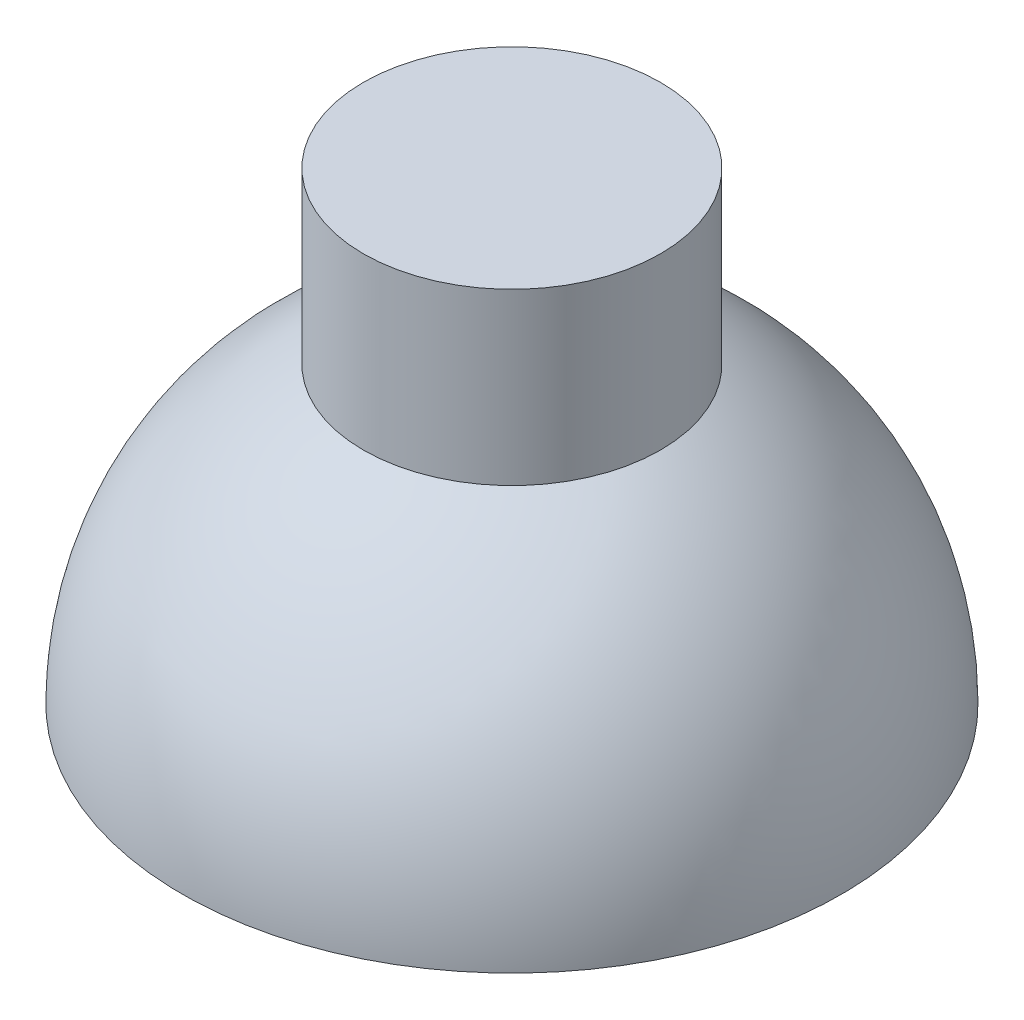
ISO-10303-21;
HEADER;
FILE_DESCRIPTION(('STEP AP214'),'2;1');
FILE_NAME('part.step','',(''),(''),'','','');
FILE_SCHEMA(('AUTOMOTIVE_DESIGN { 1 0 10303 214 1 1 1 1 }'));
ENDSEC;
DATA;
#1=APPLICATION_CONTEXT('core data for automotive mechanical design processes');
#2=APPLICATION_PROTOCOL_DEFINITION('international standard','automotive_design',2000,#1);
#3=PRODUCT_CONTEXT('',#1,'mechanical');
#4=PRODUCT('Part','Part','',(#3));
#5=PRODUCT_RELATED_PRODUCT_CATEGORY('part','',(#4));
#6=PRODUCT_DEFINITION_FORMATION('','',#4);
#7=PRODUCT_DEFINITION_CONTEXT('part definition',#1,'design');
#8=PRODUCT_DEFINITION('design','',#6,#7);
#9=PRODUCT_DEFINITION_SHAPE('','',#8);
#10=(LENGTH_UNIT() NAMED_UNIT(*) SI_UNIT(.MILLI.,.METRE.));
#11=(NAMED_UNIT(*) PLANE_ANGLE_UNIT() SI_UNIT($,.RADIAN.));
#12=(NAMED_UNIT(*) SI_UNIT($,.STERADIAN.) SOLID_ANGLE_UNIT());
#13=UNCERTAINTY_MEASURE_WITH_UNIT(LENGTH_MEASURE(1.E-05),#10,'distance_accuracy_value','');
#14=(GEOMETRIC_REPRESENTATION_CONTEXT(3) GLOBAL_UNCERTAINTY_ASSIGNED_CONTEXT((#13)) GLOBAL_UNIT_ASSIGNED_CONTEXT((#10,
#11,#12)) REPRESENTATION_CONTEXT('',''));
#15=CARTESIAN_POINT('',(0.,0.,0.));
#16=DIRECTION('',(0.,0.,1.));
#17=DIRECTION('',(1.,0.,0.));
#18=AXIS2_PLACEMENT_3D('',#15,#16,#17);
#19=CARTESIAN_POINT('',(0.,0.,0.));
#20=DIRECTION('',(0.,-1.,0.));
#21=DIRECTION('',(1.,0.,0.));
#22=AXIS2_PLACEMENT_3D('',#19,#20,#21);
#23=SPHERICAL_SURFACE('',#22,17.75);
#24=CARTESIAN_POINT('',(0.,0.,0.));
#25=DIRECTION('',(0.,-1.,0.));
#26=DIRECTION('',(0.,0.,-1.));
#27=AXIS2_PLACEMENT_3D('',#24,#25,#26);
#28=CIRCLE('',#27,17.75);
#29=CARTESIAN_POINT('',(0.,0.,-17.75));
#30=VERTEX_POINT('',#29);
#31=EDGE_CURVE('E10',#30,#30,#28,.T.);
#32=ORIENTED_EDGE('',*,*,#31,.F.);
#33=EDGE_LOOP('',(#32));
#34=FACE_BOUND('',#33,.T.);
#35=CARTESIAN_POINT('',(0.,15.8449518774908,0.));
#36=DIRECTION('',(0.,-1.,0.));
#37=DIRECTION('',(0.,0.,-1.));
#38=AXIS2_PLACEMENT_3D('',#35,#36,#37);
#39=CIRCLE('',#38,8.);
#40=CARTESIAN_POINT('',(0.,15.8449518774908,-8.));
#41=VERTEX_POINT('',#40);
#42=EDGE_CURVE('E26',#41,#41,#39,.T.);
#43=ORIENTED_EDGE('',*,*,#42,.T.);
#44=EDGE_LOOP('',(#43));
#45=FACE_BOUND('',#44,.T.);
#46=ADVANCED_FACE('F20',(#34,#45),#23,.T.);
#47=CARTESIAN_POINT('',(0.,0.,0.));
#48=DIRECTION('',(0.,-1.,0.));
#49=DIRECTION('',(0.,0.,-1.));
#50=AXIS2_PLACEMENT_3D('',#47,#48,#49);
#51=PLANE('',#50);
#52=ORIENTED_EDGE('',*,*,#31,.T.);
#53=EDGE_LOOP('',(#52));
#54=FACE_BOUND('',#53,.T.);
#55=ADVANCED_FACE('F41',(#54),#51,.T.);
#56=CARTESIAN_POINT('',(0.,25.,0.));
#57=DIRECTION('',(0.,-1.,0.));
#58=DIRECTION('',(0.,0.,-1.));
#59=AXIS2_PLACEMENT_3D('',#56,#57,#58);
#60=CYLINDRICAL_SURFACE('',#59,8.);
#61=ORIENTED_EDGE('',*,*,#42,.F.);
#62=EDGE_LOOP('',(#61));
#63=FACE_BOUND('',#62,.T.);
#64=CARTESIAN_POINT('',(0.,25.,0.));
#65=DIRECTION('',(0.,1.,0.));
#66=DIRECTION('',(0.,0.,1.));
#67=AXIS2_PLACEMENT_3D('',#64,#65,#66);
#68=CIRCLE('',#67,8.);
#69=CARTESIAN_POINT('',(0.,25.,8.));
#70=VERTEX_POINT('',#69);
#71=EDGE_CURVE('E30',#70,#70,#68,.T.);
#72=ORIENTED_EDGE('',*,*,#71,.F.);
#73=EDGE_LOOP('',(#72));
#74=FACE_BOUND('',#73,.T.);
#75=ADVANCED_FACE('F39',(#63,#74),#60,.T.);
#76=CARTESIAN_POINT('',(0.,25.,0.));
#77=DIRECTION('',(0.,1.,0.));
#78=DIRECTION('',(0.,0.,1.));
#79=AXIS2_PLACEMENT_3D('',#76,#77,#78);
#80=PLANE('',#79);
#81=ORIENTED_EDGE('',*,*,#71,.T.);
#82=EDGE_LOOP('',(#81));
#83=FACE_BOUND('',#82,.T.);
#84=ADVANCED_FACE('F37',(#83),#80,.T.);
#85=CLOSED_SHELL('',(#46,#55,#75,#84));
#86=MANIFOLD_SOLID_BREP('B2',#85);
#87=ADVANCED_BREP_SHAPE_REPRESENTATION('',(#18,#86),#14);
#88=SHAPE_DEFINITION_REPRESENTATION(#9,#87);
ENDSEC;
END-ISO-10303-21;
